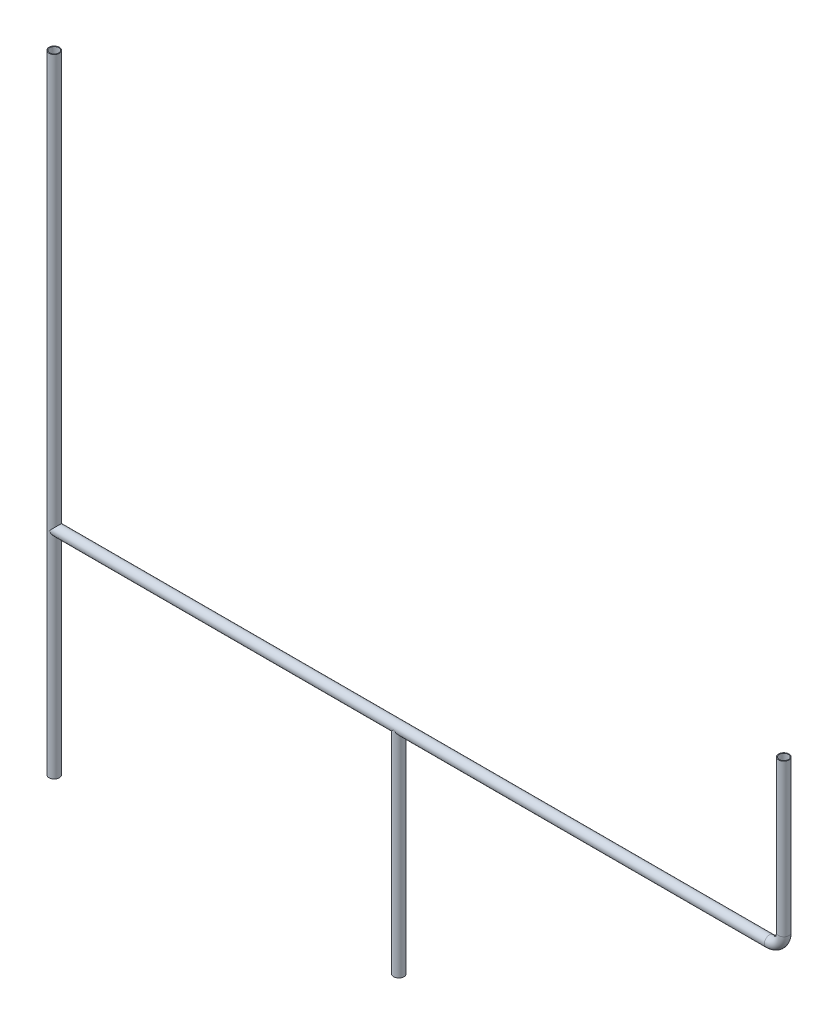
from build123d import *
from build123d.topology import SkipClean

# Parameters (mm, degrees)
CROQUIS2_R              = 11
CROQUIS2_R_2            = 9.5
CROQUIS3_R              = 11
CROQUIS3_R_2            = 9.5
SALIENTE_EXTRUIR1_DEPTH = 450


with BuildPart() as part:
    # Barrer1: sweep along a path in Croquis1
    with BuildLine(Plane.XY) as barrer1_path:
        Line((-75.857898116, 870), (-75.857898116, 0))
        Line((-75.857898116, 0), (649.142101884, 0))
        Line((649.142101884, 0), (1429.142101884, 0))
        ThreePointArc((1429.142101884, 0), (1450.355305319, 8.786796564), (1459.142101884, 30))
        Line((1459.142101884, 30), (1459.142101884, 350))
    # Croquis2 → Barrer1 (sweep)
    with BuildSketch(Plane(origin=(1459.142101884, 350, 0), x_dir=(1, 0, 0), z_dir=(0, -1, 0))):
        Circle(CROQUIS2_R)
        Circle(CROQUIS2_R_2, mode=Mode.SUBTRACT)
    sweep(path=barrer1_path.line, transition=Transition.RIGHT)

    # Croquis3 → Saliente-Extruir1 (add)
    # profile 1 of 2: a face of its own
    with SkipClean():  # the faces are left unmerged after this step: merging them gives an invalid solid
        with BuildSketch(Plane(origin=(-75.857898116, -450, 0), x_dir=(1, 0, 0), z_dir=(0, -1, 0))):
            with Locations(Location((0, 0, 0), (0, 0, 90))):
                Circle(CROQUIS3_R)
            with Locations(Location((0, 0, 0), (0, 0, 90))):
                Circle(CROQUIS3_R_2, mode=Mode.SUBTRACT)
        # profile 2 of 2: a face of its own
        with BuildSketch(Plane(origin=(-75.857898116, -450, 0), x_dir=(1, 0, 0), z_dir=(0, -1, 0))):
            with Locations((725, 0)):
                Circle(CROQUIS3_R)
            with Locations((725, 0)):
                Circle(CROQUIS3_R_2, mode=Mode.SUBTRACT)
        extrude(amount=-SALIENTE_EXTRUIR1_DEPTH)


solid = part.part
